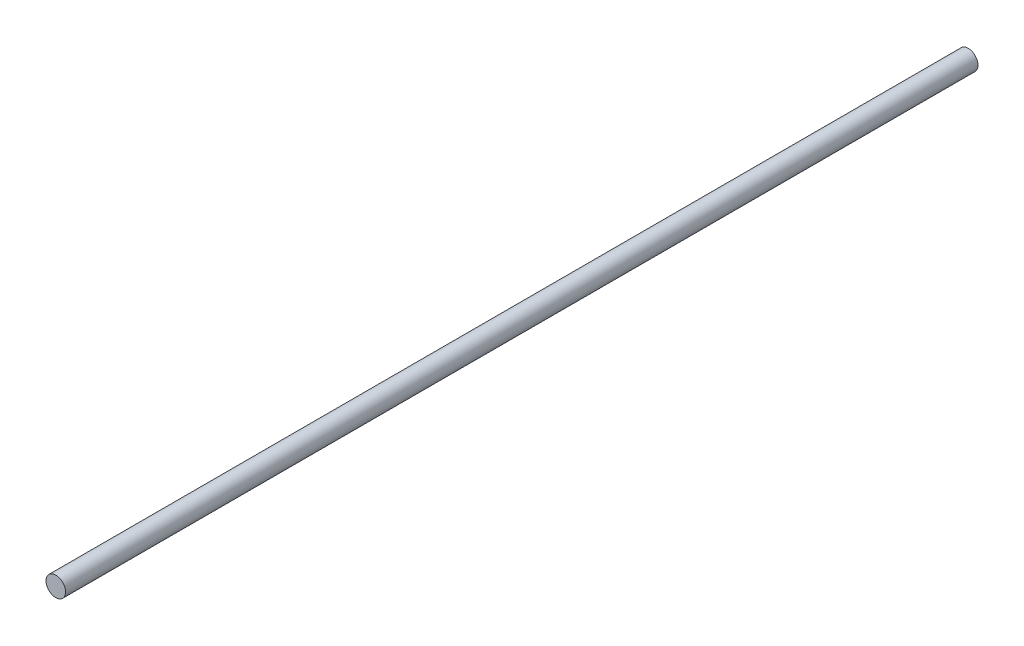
ISO-10303-21;
HEADER;
FILE_DESCRIPTION(('STEP AP214'),'2;1');
FILE_NAME('part.step','',(''),(''),'','','');
FILE_SCHEMA(('AUTOMOTIVE_DESIGN { 1 0 10303 214 1 1 1 1 }'));
ENDSEC;
DATA;
#1=APPLICATION_CONTEXT('core data for automotive mechanical design processes');
#2=APPLICATION_PROTOCOL_DEFINITION('international standard','automotive_design',2000,#1);
#3=PRODUCT_CONTEXT('',#1,'mechanical');
#4=PRODUCT('Part','Part','',(#3));
#5=PRODUCT_RELATED_PRODUCT_CATEGORY('part','',(#4));
#6=PRODUCT_DEFINITION_FORMATION('','',#4);
#7=PRODUCT_DEFINITION_CONTEXT('part definition',#1,'design');
#8=PRODUCT_DEFINITION('design','',#6,#7);
#9=PRODUCT_DEFINITION_SHAPE('','',#8);
#10=(LENGTH_UNIT() NAMED_UNIT(*) SI_UNIT(.MILLI.,.METRE.));
#11=(NAMED_UNIT(*) PLANE_ANGLE_UNIT() SI_UNIT($,.RADIAN.));
#12=(NAMED_UNIT(*) SI_UNIT($,.STERADIAN.) SOLID_ANGLE_UNIT());
#13=UNCERTAINTY_MEASURE_WITH_UNIT(LENGTH_MEASURE(1.E-05),#10,'distance_accuracy_value','');
#14=(GEOMETRIC_REPRESENTATION_CONTEXT(3) GLOBAL_UNCERTAINTY_ASSIGNED_CONTEXT((#13)) GLOBAL_UNIT_ASSIGNED_CONTEXT((#10,
#11,#12)) REPRESENTATION_CONTEXT('',''));
#15=CARTESIAN_POINT('',(0.,0.,0.));
#16=DIRECTION('',(0.,0.,1.));
#17=DIRECTION('',(1.,0.,0.));
#18=AXIS2_PLACEMENT_3D('',#15,#16,#17);
#19=CARTESIAN_POINT('',(0.,0.,-2800.));
#20=DIRECTION('',(0.,0.,1.));
#21=DIRECTION('',(1.,0.,0.));
#22=AXIS2_PLACEMENT_3D('',#19,#20,#21);
#23=CYLINDRICAL_SURFACE('',#22,30.);
#24=CARTESIAN_POINT('',(0.,0.,-2800.));
#25=DIRECTION('',(0.,0.,1.));
#26=DIRECTION('',(1.,0.,0.));
#27=AXIS2_PLACEMENT_3D('',#24,#25,#26);
#28=CIRCLE('',#27,30.);
#29=CARTESIAN_POINT('',(30.,0.,-2800.));
#30=VERTEX_POINT('',#29);
#31=EDGE_CURVE('E10',#30,#30,#28,.T.);
#32=ORIENTED_EDGE('',*,*,#31,.T.);
#33=EDGE_LOOP('',(#32));
#34=FACE_BOUND('',#33,.T.);
#35=CARTESIAN_POINT('',(0.,0.,0.));
#36=DIRECTION('',(0.,0.,1.));
#37=DIRECTION('',(1.,0.,0.));
#38=AXIS2_PLACEMENT_3D('',#35,#36,#37);
#39=CIRCLE('',#38,30.);
#40=CARTESIAN_POINT('',(30.,0.,0.));
#41=VERTEX_POINT('',#40);
#42=EDGE_CURVE('E40',#41,#41,#39,.T.);
#43=ORIENTED_EDGE('',*,*,#42,.F.);
#44=EDGE_LOOP('',(#43));
#45=FACE_BOUND('',#44,.T.);
#46=ADVANCED_FACE('F37',(#34,#45),#23,.T.);
#47=CARTESIAN_POINT('',(0.,0.,-2800.));
#48=DIRECTION('',(0.,0.,1.));
#49=DIRECTION('',(1.,0.,0.));
#50=AXIS2_PLACEMENT_3D('',#47,#48,#49);
#51=PLANE('',#50);
#52=ORIENTED_EDGE('',*,*,#31,.F.);
#53=EDGE_LOOP('',(#52));
#54=FACE_BOUND('',#53,.T.);
#55=ADVANCED_FACE('F54',(#54),#51,.F.);
#56=CARTESIAN_POINT('',(0.,0.,0.));
#57=DIRECTION('',(0.,0.,1.));
#58=DIRECTION('',(1.,0.,0.));
#59=AXIS2_PLACEMENT_3D('',#56,#57,#58);
#60=PLANE('',#59);
#61=ORIENTED_EDGE('',*,*,#42,.T.);
#62=EDGE_LOOP('',(#61));
#63=FACE_BOUND('',#62,.T.);
#64=ADVANCED_FACE('F51',(#63),#60,.T.);
#65=CLOSED_SHELL('',(#46,#55,#64));
#66=MANIFOLD_SOLID_BREP('B2',#65);
#67=ADVANCED_BREP_SHAPE_REPRESENTATION('',(#18,#66),#14);
#68=SHAPE_DEFINITION_REPRESENTATION(#9,#67);
ENDSEC;
END-ISO-10303-21;
